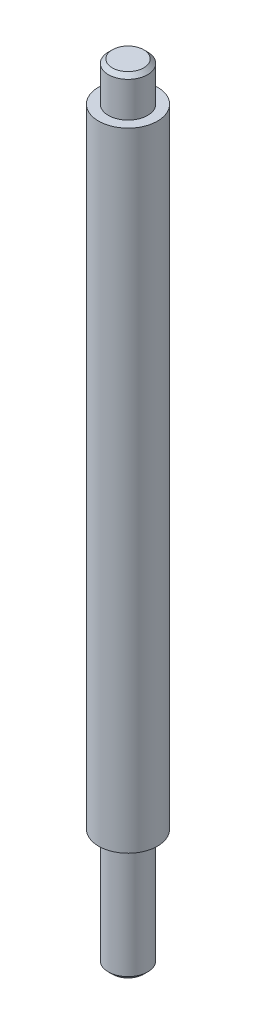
from build123d import *

# Parameters (mm, degrees)
CHANFREIN1_SIZE = 2


with BuildPart() as part:
    # Esquisse1 → Base-R_volution (revolve)
    with BuildSketch(Plane.XY, mode=Mode.PRIVATE) as base_r_volution_sk:
        Polygon((0, 0), (-10, 0), (-10, 60), (-15, 60), (-15, 380), (-10, 380), (-10, 400), (0, 400), align=None)
    revolve(base_r_volution_sk.sketch.rotate(Axis((0, 0, 0), (0, 1, 0)), 270), axis=Axis((0, 0, 0), (0, 1, 0)))

    # Chanfrein1
    chanfrein1_edges = [part.edges().sort_by_distance(p)[0] for p in [
        (0, 0, 10),
        (0, 400, 10),
    ]]
    chamfer(chanfrein1_edges, length=CHANFREIN1_SIZE)


solid = part.part
